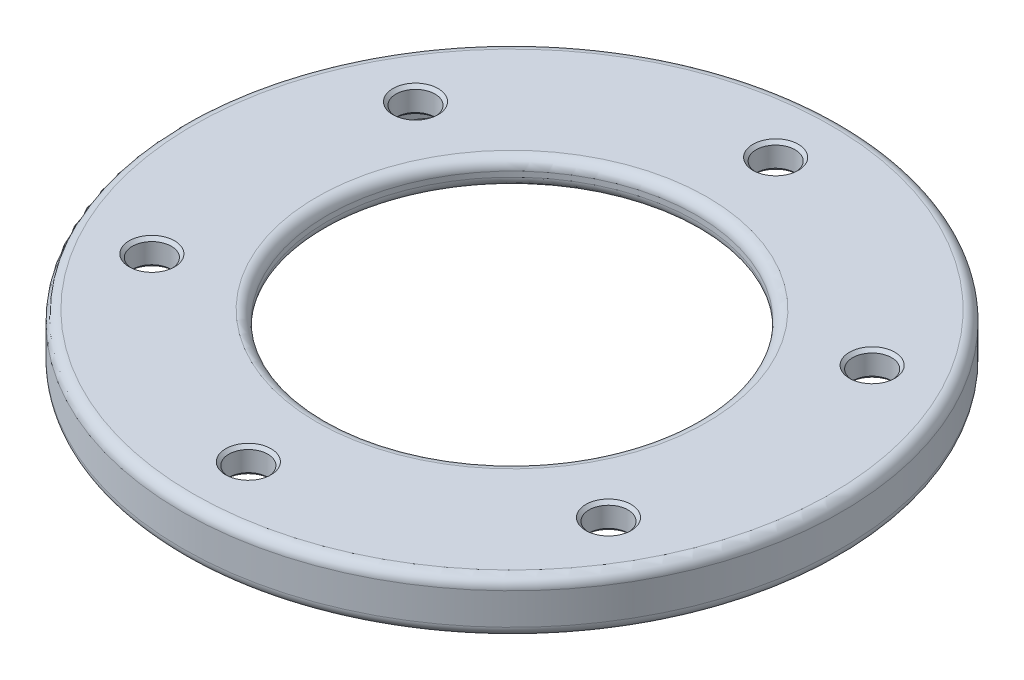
from build123d import *

# Parameters (mm, degrees)
SKETCH1_R                            = 39.6875
SKETCH1_R_2                          = 22.225
BOSS_EXTRUDE1_DEPTH                  = 3.175
BOSS_EXTRUDE2_START                  = 3.175
SKETCH2_R                            = 39.6875
SKETCH2_R_2                          = 37.9095
BOSS_EXTRUDE2_DEPTH                  = 3.175
F_13_0_185_DIAMETER_HOLE1_AT_2_COUNT = 2
F_13_0_185_DIAMETER_HOLE1_AT_2_PITCH = 31.75
F_13_0_185_DIAMETER_HOLE1_AT_3_COUNT = 2
F_13_0_185_DIAMETER_HOLE1_AT_3_PITCH = 54.99261314
F_13_0_185_DIAMETER_HOLE1_AT_4_COUNT = 2
F_13_0_185_DIAMETER_HOLE1_AT_4_PITCH = 63.5
F_13_0_185_DIAMETER_HOLE1_AT_5_COUNT = 2
F_13_0_185_DIAMETER_HOLE1_AT_5_PITCH = 54.99261314
F_13_0_185_DIAMETER_HOLE1_AT_6_COUNT = 2
F_13_0_185_DIAMETER_HOLE1_AT_6_PITCH = 31.75
FILLET1_R                            = 1.27


with BuildPart() as part:
    # Sketch1 → Boss-Extrude1 (new body)
    with BuildSketch(Plane(origin=(0, 0, 0), x_dir=(1, 0, 0), z_dir=(0, 1, 0))):
        with Locations(Location((0, 0, 0), (0, 0, 270))):
            Circle(SKETCH1_R)
        with Locations(Location((0, 0, 0), (0, 0, 270))):
            Circle(SKETCH1_R_2, mode=Mode.SUBTRACT)
    extrude(amount=BOSS_EXTRUDE1_DEPTH)

    # Sketch2 → Boss-Extrude2 (add)
    with BuildSketch(Plane.XZ.offset(BOSS_EXTRUDE2_START)):
        with Locations(Location((0, 0, 0), (0, 0, 270))):
            Circle(SKETCH2_R)
        with Locations(Location((0, 0, 0), (0, 0, 270))):
            Circle(SKETCH2_R_2, mode=Mode.SUBTRACT)
    extrude(amount=-BOSS_EXTRUDE2_DEPTH)

    # Sketch4 → 13 _0.185_ Diameter Hole1 (revolve, cut)
    with BuildSketch(Plane(origin=(0, 3.175, -31.75), x_dir=(0, 0, 1), z_dir=(1, 0, 0))):
        Polygon((0, 0), (0, 3.175), (2.7305, 3.175), (2.3495, 2.794), (2.3495, 0.381), (2.7305, 0), align=None)
    f_13_0_185_diameter_hole1 = revolve(axis=Axis((0, 9.525, -31.75), (0, -1, 0)), mode=Mode.SUBTRACT)

    # 13 _0.185_ Diameter Hole1 at 2: 13 _0.185_ Diameter Hole1 ×2
    with Locations(*[Vector(0.8660254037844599, 0, 0.4999999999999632) * (i * F_13_0_185_DIAMETER_HOLE1_AT_2_PITCH) for i in range(1, F_13_0_185_DIAMETER_HOLE1_AT_2_COUNT)]):
        add(f_13_0_185_diameter_hole1, mode=Mode.SUBTRACT)

    # 13 _0.185_ Diameter Hole1 at 3: 13 _0.185_ Diameter Hole1 ×2
    with Locations(*[Vector(0.5000000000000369, 0, 0.8660254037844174) * (i * F_13_0_185_DIAMETER_HOLE1_AT_3_PITCH) for i in range(1, F_13_0_185_DIAMETER_HOLE1_AT_3_COUNT)]):
        add(f_13_0_185_diameter_hole1, mode=Mode.SUBTRACT)

    # 13 _0.185_ Diameter Hole1 at 4: 13 _0.185_ Diameter Hole1 ×2
    with Locations(*[(0, 0, i * F_13_0_185_DIAMETER_HOLE1_AT_4_PITCH) for i in range(1, F_13_0_185_DIAMETER_HOLE1_AT_4_COUNT)]):
        add(f_13_0_185_diameter_hole1, mode=Mode.SUBTRACT)

    # 13 _0.185_ Diameter Hole1 at 5: 13 _0.185_ Diameter Hole1 ×2
    with Locations(*[Vector(-0.4999999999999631, 0, 0.86602540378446) * (i * F_13_0_185_DIAMETER_HOLE1_AT_5_PITCH) for i in range(1, F_13_0_185_DIAMETER_HOLE1_AT_5_COUNT)]):
        add(f_13_0_185_diameter_hole1, mode=Mode.SUBTRACT)

    # 13 _0.185_ Diameter Hole1 at 6: 13 _0.185_ Diameter Hole1 ×2
    with Locations(*[Vector(-0.8660254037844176, 0, 0.5000000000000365) * (i * F_13_0_185_DIAMETER_HOLE1_AT_6_PITCH) for i in range(1, F_13_0_185_DIAMETER_HOLE1_AT_6_COUNT)]):
        add(f_13_0_185_diameter_hole1, mode=Mode.SUBTRACT)

    # Fillet1
    fillet1_edges = [part.edges().sort_by_distance(p)[0] for p in [
        (0, -3.175, 39.6875),
        (0, 3.175, -39.6875),
        (0, 0, -22.225),
        (0, 3.175, -22.225),
    ]]
    fillet(fillet1_edges, radius=FILLET1_R)


solid = part.part
